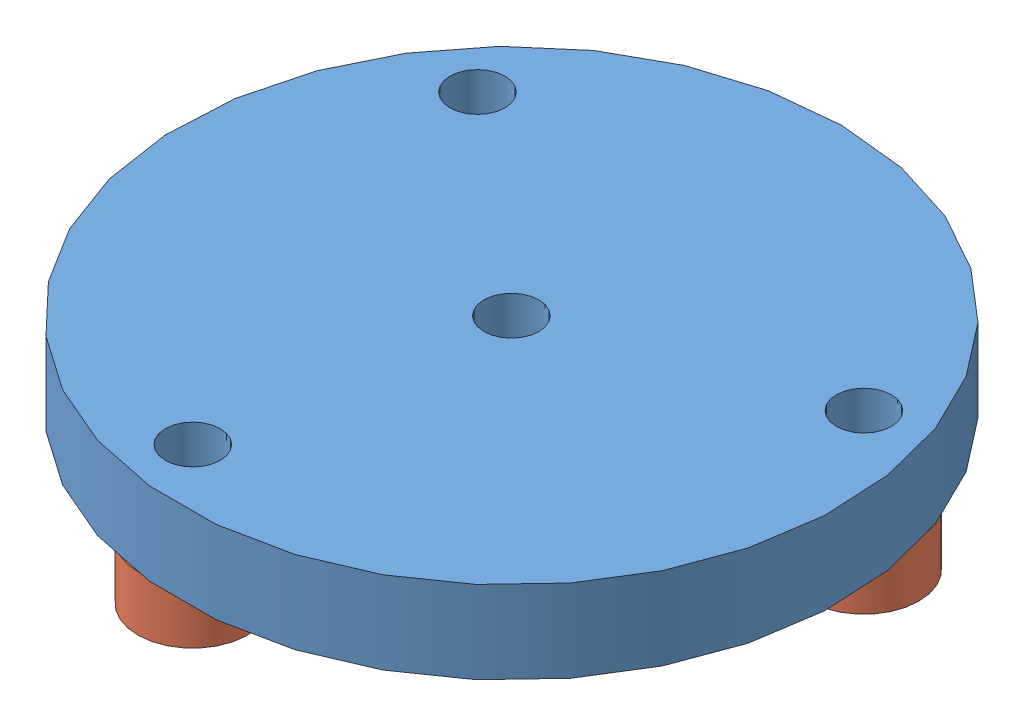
SolidWorks assembly Movingplate.SLDASM, configuration ﾃﾞﾌｫﾙﾄ (file format 4400). Lengths in mm.
Overall size (242.17 50 246.74).
5 component instances, 2 part files, 8 mates.
Components (placement in the parent):
- Movingplate-1: Movingplate.SLDPRT [ﾃﾞﾌｫﾙﾄ] at (-40.4258 -73.1121 0) size (240 30 240)
- Pivot-1: Pivot.SLDPRT [ﾃﾞﾌｫﾙﾄ] at (53.5434 -63.1121 -34.202) x (-0.760585 0 -0.649239) z (-0.649239 0 0.760585) size (40 30 40)
- Pivot-2: Pivot.SLDPRT [ﾃﾞﾌｫﾙﾄ] at (-57.7906 -63.1121 98.4808) x (-0.73699 0 -0.675903) z (-0.675903 0 0.73699) size (40 30 40)
- Pivot-3: Pivot.SLDPRT [ﾃﾞﾌｫﾙﾄ] at (-117.0303 -63.1121 -64.2788) x (-0.704167 0 0.710034) z (0.710034 0 0.704167) size (40 30 40)
- Pivot-4: Pivot.SLDPRT [ﾃﾞﾌｫﾙﾄ] at (-40.4258 -63.1121 0) x (-0.837169 0 -0.546944) z (-0.546944 0 0.837169) size (40 30 40)
Mates (geometry in assembly coordinates):
- 一致1: coincident aligned: cylinder of Pivot-2 through (-57.7906 -37.9841 98.4808) axis (0 1 0) radius 10; circle of Movingplate-1
- 同心円1: concentric aligned: cylinder of Pivot-1 through (53.5434 -37.9841 -34.202) axis (0 1 0) radius 10; cylinder of Movingplate-1 through (53.5434 -73.1121 -34.202) axis (0 1 0) radius 10
- 同心円2: concentric aligned: cylinder of Pivot-3 through (-117.0303 -37.9841 -64.2788) axis (0 1 0) radius 10; cylinder of Movingplate-1 through (-117.0303 -73.1121 -64.2788) axis (0 1 0) radius 10
- 一致3: coincident anti-aligned: plane of Movingplate-1 through (-40.4258 -73.1121 0) normal (0 -1 0); plane of Pivot-1 through (45.9376 -73.1121 -40.6944) normal (0 1 0)
- 一致4: coincident anti-aligned: plane of Movingplate-1 through (-40.4258 -73.1121 0) normal (0 -1 0); plane of Pivot-3 through (-124.0719 -73.1121 -57.1784) normal (0 1 0)
- 一致5: coincident anti-aligned: plane of Movingplate-1 through (-40.4258 -73.1121 0) normal (0 -1 0); plane of Pivot-2 through (-65.1605 -73.1121 91.7217) normal (0 1 0)
- 同心円3: concentric: cylinder of Pivot-4 through (-40.4258 -37.9841 0) axis (0 1 0) radius 10; cylinder of Movingplate-1 through (-40.4258 -73.1121 0) axis (0 1 0) radius 10
- 一致6: coincident anti-aligned: plane of Movingplate-1 through (-40.4258 -73.1121 0) normal (0 -1 0); plane of Pivot-4 through (-48.7975 -73.1121 -5.4694) normal (0 1 0)
